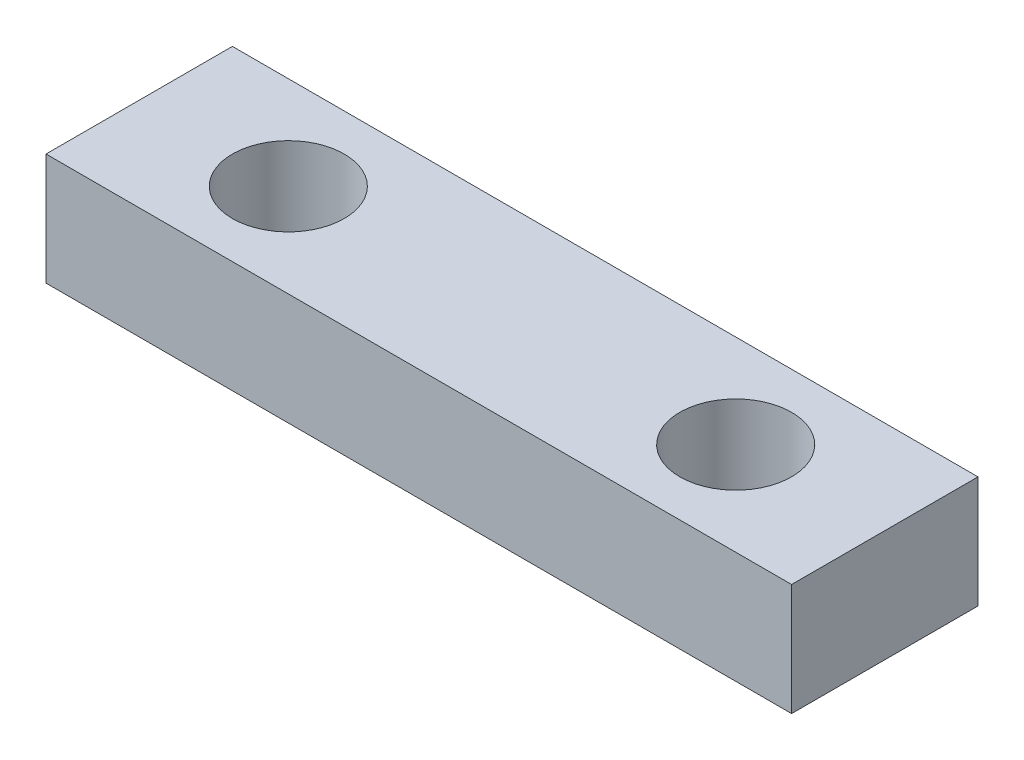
ISO-10303-21;
HEADER;
FILE_DESCRIPTION(('STEP AP214'),'2;1');
FILE_NAME('part.step','',(''),(''),'','','');
FILE_SCHEMA(('AUTOMOTIVE_DESIGN { 1 0 10303 214 1 1 1 1 }'));
ENDSEC;
DATA;
#1=APPLICATION_CONTEXT('core data for automotive mechanical design processes');
#2=APPLICATION_PROTOCOL_DEFINITION('international standard','automotive_design',2000,#1);
#3=PRODUCT_CONTEXT('',#1,'mechanical');
#4=PRODUCT('Part','Part','',(#3));
#5=PRODUCT_RELATED_PRODUCT_CATEGORY('part','',(#4));
#6=PRODUCT_DEFINITION_FORMATION('','',#4);
#7=PRODUCT_DEFINITION_CONTEXT('part definition',#1,'design');
#8=PRODUCT_DEFINITION('design','',#6,#7);
#9=PRODUCT_DEFINITION_SHAPE('','',#8);
#10=(LENGTH_UNIT() NAMED_UNIT(*) SI_UNIT(.MILLI.,.METRE.));
#11=(NAMED_UNIT(*) PLANE_ANGLE_UNIT() SI_UNIT($,.RADIAN.));
#12=(NAMED_UNIT(*) SI_UNIT($,.STERADIAN.) SOLID_ANGLE_UNIT());
#13=UNCERTAINTY_MEASURE_WITH_UNIT(LENGTH_MEASURE(1.E-05),#10,'distance_accuracy_value','');
#14=(GEOMETRIC_REPRESENTATION_CONTEXT(3) GLOBAL_UNCERTAINTY_ASSIGNED_CONTEXT((#13)) GLOBAL_UNIT_ASSIGNED_CONTEXT((#10,
#11,#12)) REPRESENTATION_CONTEXT('',''));
#15=CARTESIAN_POINT('',(0.,0.,0.));
#16=DIRECTION('',(0.,0.,1.));
#17=DIRECTION('',(1.,0.,0.));
#18=AXIS2_PLACEMENT_3D('',#15,#16,#17);
#19=CARTESIAN_POINT('',(10.,3.,-2.5));
#20=DIRECTION('',(-1.,0.,0.));
#21=DIRECTION('',(0.,0.,1.));
#22=AXIS2_PLACEMENT_3D('',#19,#20,#21);
#23=PLANE('',#22);
#24=DIRECTION('',(0.,0.,-1.));
#25=VECTOR('',#24,1.);
#26=CARTESIAN_POINT('',(10.,0.,-2.5));
#27=LINE('',#26,#25);
#28=CARTESIAN_POINT('',(10.,0.,2.5));
#29=VERTEX_POINT('',#28);
#30=CARTESIAN_POINT('',(10.,0.,-2.5));
#31=VERTEX_POINT('',#30);
#32=EDGE_CURVE('E97',#29,#31,#27,.T.);
#33=ORIENTED_EDGE('',*,*,#32,.T.);
#34=DIRECTION('',(0.,-1.,0.));
#35=VECTOR('',#34,1.);
#36=CARTESIAN_POINT('',(10.,3.,-2.5));
#37=LINE('',#36,#35);
#38=CARTESIAN_POINT('',(10.,3.,-2.5));
#39=VERTEX_POINT('',#38);
#40=EDGE_CURVE('E11',#39,#31,#37,.T.);
#41=ORIENTED_EDGE('',*,*,#40,.F.);
#42=DIRECTION('',(0.,0.,-1.));
#43=VECTOR('',#42,1.);
#44=CARTESIAN_POINT('',(10.,3.,-2.5));
#45=LINE('',#44,#43);
#46=CARTESIAN_POINT('',(10.,3.,2.5));
#47=VERTEX_POINT('',#46);
#48=EDGE_CURVE('E85',#47,#39,#45,.T.);
#49=ORIENTED_EDGE('',*,*,#48,.F.);
#50=DIRECTION('',(0.,-1.,0.));
#51=VECTOR('',#50,1.);
#52=CARTESIAN_POINT('',(10.,3.,2.5));
#53=LINE('',#52,#51);
#54=EDGE_CURVE('E93',#47,#29,#53,.T.);
#55=ORIENTED_EDGE('',*,*,#54,.T.);
#56=EDGE_LOOP('',(#33,#41,#49,#55));
#57=FACE_BOUND('',#56,.T.);
#58=ADVANCED_FACE('F34',(#57),#23,.F.);
#59=CARTESIAN_POINT('',(-10.,3.,-2.5));
#60=DIRECTION('',(0.,0.,1.));
#61=DIRECTION('',(1.,0.,0.));
#62=AXIS2_PLACEMENT_3D('',#59,#60,#61);
#63=PLANE('',#62);
#64=DIRECTION('',(-1.,0.,0.));
#65=VECTOR('',#64,1.);
#66=CARTESIAN_POINT('',(-10.,0.,-2.5));
#67=LINE('',#66,#65);
#68=CARTESIAN_POINT('',(-10.,0.,-2.5));
#69=VERTEX_POINT('',#68);
#70=EDGE_CURVE('E89',#31,#69,#67,.T.);
#71=ORIENTED_EDGE('',*,*,#70,.T.);
#72=DIRECTION('',(0.,-1.,0.));
#73=VECTOR('',#72,1.);
#74=CARTESIAN_POINT('',(-10.,3.,-2.5));
#75=LINE('',#74,#73);
#76=CARTESIAN_POINT('',(-10.,3.,-2.5));
#77=VERTEX_POINT('',#76);
#78=EDGE_CURVE('E42',#77,#69,#75,.T.);
#79=ORIENTED_EDGE('',*,*,#78,.F.);
#80=DIRECTION('',(-1.,0.,0.));
#81=VECTOR('',#80,1.);
#82=CARTESIAN_POINT('',(-10.,3.,-2.5));
#83=LINE('',#82,#81);
#84=EDGE_CURVE('E80',#39,#77,#83,.T.);
#85=ORIENTED_EDGE('',*,*,#84,.F.);
#86=ORIENTED_EDGE('',*,*,#40,.T.);
#87=EDGE_LOOP('',(#71,#79,#85,#86));
#88=FACE_BOUND('',#87,.T.);
#89=ADVANCED_FACE('F88',(#88),#63,.F.);
#90=CARTESIAN_POINT('',(-10.,3.,-2.5));
#91=DIRECTION('',(1.,0.,0.));
#92=DIRECTION('',(0.,0.,-1.));
#93=AXIS2_PLACEMENT_3D('',#90,#91,#92);
#94=PLANE('',#93);
#95=DIRECTION('',(0.,0.,1.));
#96=VECTOR('',#95,1.);
#97=CARTESIAN_POINT('',(-10.,0.,-2.5));
#98=LINE('',#97,#96);
#99=CARTESIAN_POINT('',(-10.,0.,2.5));
#100=VERTEX_POINT('',#99);
#101=EDGE_CURVE('E67',#69,#100,#98,.T.);
#102=ORIENTED_EDGE('',*,*,#101,.T.);
#103=DIRECTION('',(0.,-1.,0.));
#104=VECTOR('',#103,1.);
#105=CARTESIAN_POINT('',(-10.,3.,2.5));
#106=LINE('',#105,#104);
#107=CARTESIAN_POINT('',(-10.,3.,2.5));
#108=VERTEX_POINT('',#107);
#109=EDGE_CURVE('E90',#108,#100,#106,.T.);
#110=ORIENTED_EDGE('',*,*,#109,.F.);
#111=DIRECTION('',(0.,0.,1.));
#112=VECTOR('',#111,1.);
#113=CARTESIAN_POINT('',(-10.,3.,-2.5));
#114=LINE('',#113,#112);
#115=EDGE_CURVE('E83',#77,#108,#114,.T.);
#116=ORIENTED_EDGE('',*,*,#115,.F.);
#117=ORIENTED_EDGE('',*,*,#78,.T.);
#118=EDGE_LOOP('',(#102,#110,#116,#117));
#119=FACE_BOUND('',#118,.T.);
#120=ADVANCED_FACE('F91',(#119),#94,.F.);
#121=CARTESIAN_POINT('',(-10.,3.,2.5));
#122=DIRECTION('',(0.,0.,-1.));
#123=DIRECTION('',(-1.,0.,0.));
#124=AXIS2_PLACEMENT_3D('',#121,#122,#123);
#125=PLANE('',#124);
#126=DIRECTION('',(1.,0.,0.));
#127=VECTOR('',#126,1.);
#128=CARTESIAN_POINT('',(-10.,0.,2.5));
#129=LINE('',#128,#127);
#130=EDGE_CURVE('E73',#100,#29,#129,.T.);
#131=ORIENTED_EDGE('',*,*,#130,.T.);
#132=ORIENTED_EDGE('',*,*,#54,.F.);
#133=DIRECTION('',(1.,0.,0.));
#134=VECTOR('',#133,1.);
#135=CARTESIAN_POINT('',(-10.,3.,2.5));
#136=LINE('',#135,#134);
#137=EDGE_CURVE('E50',#108,#47,#136,.T.);
#138=ORIENTED_EDGE('',*,*,#137,.F.);
#139=ORIENTED_EDGE('',*,*,#109,.T.);
#140=EDGE_LOOP('',(#131,#132,#138,#139));
#141=FACE_BOUND('',#140,.T.);
#142=ADVANCED_FACE('F105',(#141),#125,.F.);
#143=CARTESIAN_POINT('',(0.,3.,0.));
#144=DIRECTION('',(0.,1.,0.));
#145=DIRECTION('',(0.,0.,1.));
#146=AXIS2_PLACEMENT_3D('',#143,#144,#145);
#147=PLANE('',#146);
#148=CARTESIAN_POINT('',(6.,3.,0.));
#149=DIRECTION('',(0.,1.,0.));
#150=DIRECTION('',(0.,0.,1.));
#151=AXIS2_PLACEMENT_3D('',#148,#149,#150);
#152=CIRCLE('',#151,1.5);
#153=CARTESIAN_POINT('',(6.,3.,1.5));
#154=VERTEX_POINT('',#153);
#155=EDGE_CURVE('E117',#154,#154,#152,.T.);
#156=ORIENTED_EDGE('',*,*,#155,.F.);
#157=EDGE_LOOP('',(#156));
#158=FACE_BOUND('',#157,.T.);
#159=CARTESIAN_POINT('',(-6.,3.,0.));
#160=DIRECTION('',(0.,1.,0.));
#161=DIRECTION('',(0.,0.,1.));
#162=AXIS2_PLACEMENT_3D('',#159,#160,#161);
#163=CIRCLE('',#162,1.5);
#164=CARTESIAN_POINT('',(-6.,3.,1.5));
#165=VERTEX_POINT('',#164);
#166=EDGE_CURVE('E111',#165,#165,#163,.T.);
#167=ORIENTED_EDGE('',*,*,#166,.F.);
#168=EDGE_LOOP('',(#167));
#169=FACE_BOUND('',#168,.T.);
#170=ORIENTED_EDGE('',*,*,#48,.T.);
#171=ORIENTED_EDGE('',*,*,#84,.T.);
#172=ORIENTED_EDGE('',*,*,#115,.T.);
#173=ORIENTED_EDGE('',*,*,#137,.T.);
#174=EDGE_LOOP('',(#170,#171,#172,#173));
#175=FACE_BOUND('',#174,.T.);
#176=ADVANCED_FACE('F81',(#158,#169,#175),#147,.T.);
#177=CARTESIAN_POINT('',(0.,0.,0.));
#178=DIRECTION('',(0.,1.,0.));
#179=DIRECTION('',(0.,0.,1.));
#180=AXIS2_PLACEMENT_3D('',#177,#178,#179);
#181=PLANE('',#180);
#182=CARTESIAN_POINT('',(6.,0.,0.));
#183=DIRECTION('',(0.,1.,0.));
#184=DIRECTION('',(0.,0.,1.));
#185=AXIS2_PLACEMENT_3D('',#182,#183,#184);
#186=CIRCLE('',#185,1.5);
#187=CARTESIAN_POINT('',(6.,0.,1.5));
#188=VERTEX_POINT('',#187);
#189=EDGE_CURVE('E114',#188,#188,#186,.T.);
#190=ORIENTED_EDGE('',*,*,#189,.T.);
#191=EDGE_LOOP('',(#190));
#192=FACE_BOUND('',#191,.T.);
#193=CARTESIAN_POINT('',(-6.,0.,0.));
#194=DIRECTION('',(0.,1.,0.));
#195=DIRECTION('',(0.,0.,1.));
#196=AXIS2_PLACEMENT_3D('',#193,#194,#195);
#197=CIRCLE('',#196,1.5);
#198=CARTESIAN_POINT('',(-6.,0.,1.5));
#199=VERTEX_POINT('',#198);
#200=EDGE_CURVE('E100',#199,#199,#197,.T.);
#201=ORIENTED_EDGE('',*,*,#200,.T.);
#202=EDGE_LOOP('',(#201));
#203=FACE_BOUND('',#202,.T.);
#204=ORIENTED_EDGE('',*,*,#32,.F.);
#205=ORIENTED_EDGE('',*,*,#130,.F.);
#206=ORIENTED_EDGE('',*,*,#101,.F.);
#207=ORIENTED_EDGE('',*,*,#70,.F.);
#208=EDGE_LOOP('',(#204,#205,#206,#207));
#209=FACE_BOUND('',#208,.T.);
#210=ADVANCED_FACE('F108',(#192,#203,#209),#181,.F.);
#211=CARTESIAN_POINT('',(-6.,0.,0.));
#212=DIRECTION('',(0.,1.,0.));
#213=DIRECTION('',(0.,0.,1.));
#214=AXIS2_PLACEMENT_3D('',#211,#212,#213);
#215=CYLINDRICAL_SURFACE('',#214,1.5);
#216=ORIENTED_EDGE('',*,*,#200,.F.);
#217=EDGE_LOOP('',(#216));
#218=FACE_BOUND('',#217,.T.);
#219=ORIENTED_EDGE('',*,*,#166,.T.);
#220=EDGE_LOOP('',(#219));
#221=FACE_BOUND('',#220,.T.);
#222=ADVANCED_FACE('F128',(#218,#221),#215,.F.);
#223=CARTESIAN_POINT('',(6.,0.,0.));
#224=DIRECTION('',(0.,1.,0.));
#225=DIRECTION('',(0.,0.,1.));
#226=AXIS2_PLACEMENT_3D('',#223,#224,#225);
#227=CYLINDRICAL_SURFACE('',#226,1.5);
#228=ORIENTED_EDGE('',*,*,#189,.F.);
#229=EDGE_LOOP('',(#228));
#230=FACE_BOUND('',#229,.T.);
#231=ORIENTED_EDGE('',*,*,#155,.T.);
#232=EDGE_LOOP('',(#231));
#233=FACE_BOUND('',#232,.T.);
#234=ADVANCED_FACE('F125',(#230,#233),#227,.F.);
#235=CLOSED_SHELL('',(#58,#89,#120,#142,#176,#210,#222,#234));
#236=MANIFOLD_SOLID_BREP('B2',#235);
#237=ADVANCED_BREP_SHAPE_REPRESENTATION('',(#18,#236),#14);
#238=SHAPE_DEFINITION_REPRESENTATION(#9,#237);
ENDSEC;
END-ISO-10303-21;
